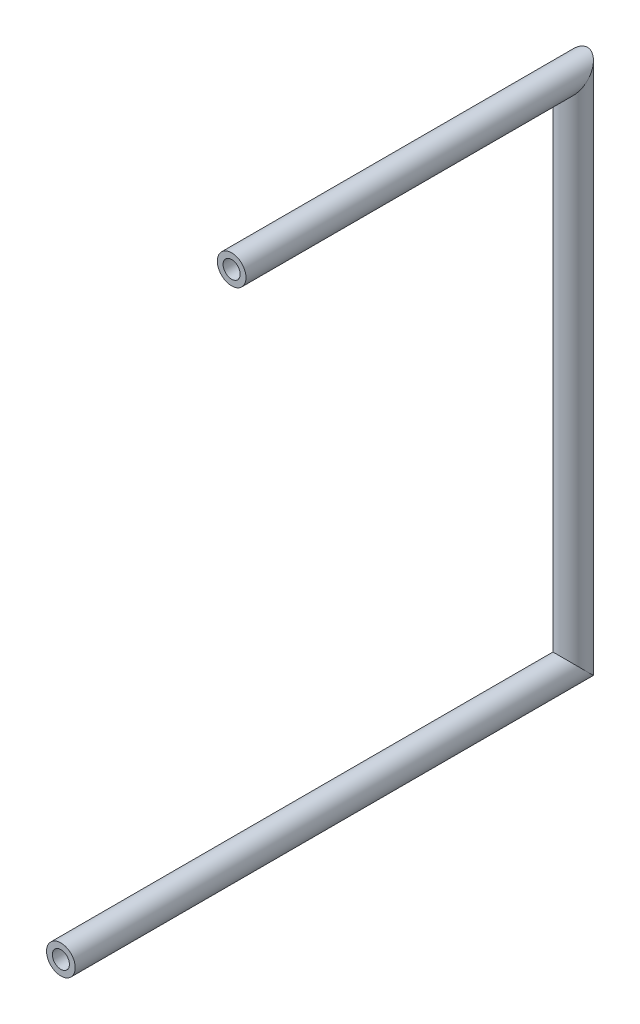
ISO-10303-21;
HEADER;
FILE_DESCRIPTION(('STEP AP214'),'2;1');
FILE_NAME('part.step','',(''),(''),'','','');
FILE_SCHEMA(('AUTOMOTIVE_DESIGN { 1 0 10303 214 1 1 1 1 }'));
ENDSEC;
DATA;
#1=APPLICATION_CONTEXT('core data for automotive mechanical design processes');
#2=APPLICATION_PROTOCOL_DEFINITION('international standard','automotive_design',2000,#1);
#3=PRODUCT_CONTEXT('',#1,'mechanical');
#4=PRODUCT('Part','Part','',(#3));
#5=PRODUCT_RELATED_PRODUCT_CATEGORY('part','',(#4));
#6=PRODUCT_DEFINITION_FORMATION('','',#4);
#7=PRODUCT_DEFINITION_CONTEXT('part definition',#1,'design');
#8=PRODUCT_DEFINITION('design','',#6,#7);
#9=PRODUCT_DEFINITION_SHAPE('','',#8);
#10=(LENGTH_UNIT() NAMED_UNIT(*) SI_UNIT(.MILLI.,.METRE.));
#11=(NAMED_UNIT(*) PLANE_ANGLE_UNIT() SI_UNIT($,.RADIAN.));
#12=(NAMED_UNIT(*) SI_UNIT($,.STERADIAN.) SOLID_ANGLE_UNIT());
#13=UNCERTAINTY_MEASURE_WITH_UNIT(LENGTH_MEASURE(1.E-05),#10,'distance_accuracy_value','');
#14=(GEOMETRIC_REPRESENTATION_CONTEXT(3) GLOBAL_UNCERTAINTY_ASSIGNED_CONTEXT((#13)) GLOBAL_UNIT_ASSIGNED_CONTEXT((#10,
#11,#12)) REPRESENTATION_CONTEXT('',''));
#15=CARTESIAN_POINT('',(0.,0.,0.));
#16=DIRECTION('',(0.,0.,1.));
#17=DIRECTION('',(1.,0.,0.));
#18=AXIS2_PLACEMENT_3D('',#15,#16,#17);
#19=CARTESIAN_POINT('',(0.,381.,-404.5696));
#20=DIRECTION('',(0.,0.,1.));
#21=DIRECTION('',(1.,0.,0.));
#22=AXIS2_PLACEMENT_3D('',#19,#20,#21);
#23=CYLINDRICAL_SURFACE('',#22,10.668);
#24=CARTESIAN_POINT('',(0.,381.,-381.));
#25=DIRECTION('',(0.,0.707106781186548,0.707106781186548));
#26=DIRECTION('',(0.,0.707106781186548,-0.707106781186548));
#27=AXIS2_PLACEMENT_3D('',#24,#25,#26);
#28=ELLIPSE('',#27,15.0868302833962,10.668);
#29=CARTESIAN_POINT('',(0.,391.668,-391.668));
#30=VERTEX_POINT('',#29);
#31=EDGE_CURVE('E34',#30,#30,#28,.T.);
#32=ORIENTED_EDGE('',*,*,#31,.T.);
#33=EDGE_LOOP('',(#32));
#34=FACE_BOUND('',#33,.T.);
#35=CARTESIAN_POINT('',(0.,381.,-127.));
#36=DIRECTION('',(0.,0.,-1.));
#37=DIRECTION('',(1.,0.,0.));
#38=AXIS2_PLACEMENT_3D('',#35,#36,#37);
#39=CIRCLE('',#38,10.668);
#40=CARTESIAN_POINT('',(10.668,381.,-127.));
#41=VERTEX_POINT('',#40);
#42=EDGE_CURVE('E54',#41,#41,#39,.T.);
#43=ORIENTED_EDGE('',*,*,#42,.T.);
#44=EDGE_LOOP('',(#43));
#45=FACE_BOUND('',#44,.T.);
#46=ADVANCED_FACE('F31',(#34,#45),#23,.T.);
#47=CARTESIAN_POINT('',(0.,-23.5695999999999,-381.));
#48=DIRECTION('',(0.,1.,0.));
#49=DIRECTION('',(0.,0.,1.));
#50=AXIS2_PLACEMENT_3D('',#47,#48,#49);
#51=CYLINDRICAL_SURFACE('',#50,10.668);
#52=CARTESIAN_POINT('',(0.,0.,-381.));
#53=DIRECTION('',(0.,0.707106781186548,-0.707106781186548));
#54=DIRECTION('',(0.,-0.707106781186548,-0.707106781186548));
#55=AXIS2_PLACEMENT_3D('',#52,#53,#54);
#56=ELLIPSE('',#55,15.0868302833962,10.668);
#57=CARTESIAN_POINT('',(0.,-10.668,-391.668));
#58=VERTEX_POINT('',#57);
#59=EDGE_CURVE('E56',#58,#58,#56,.T.);
#60=ORIENTED_EDGE('',*,*,#59,.T.);
#61=EDGE_LOOP('',(#60));
#62=FACE_BOUND('',#61,.T.);
#63=ORIENTED_EDGE('',*,*,#31,.F.);
#64=EDGE_LOOP('',(#63));
#65=FACE_BOUND('',#64,.T.);
#66=ADVANCED_FACE('F65',(#62,#65),#51,.T.);
#67=CARTESIAN_POINT('',(0.,0.,0.));
#68=DIRECTION('',(0.,0.,-1.));
#69=DIRECTION('',(-1.,0.,0.));
#70=AXIS2_PLACEMENT_3D('',#67,#68,#69);
#71=CYLINDRICAL_SURFACE('',#70,10.668);
#72=CARTESIAN_POINT('',(0.,0.,0.));
#73=DIRECTION('',(0.,0.,1.));
#74=DIRECTION('',(1.,0.,0.));
#75=AXIS2_PLACEMENT_3D('',#72,#73,#74);
#76=CIRCLE('',#75,10.668);
#77=CARTESIAN_POINT('',(10.668,0.,0.));
#78=VERTEX_POINT('',#77);
#79=EDGE_CURVE('E51',#78,#78,#76,.T.);
#80=ORIENTED_EDGE('',*,*,#79,.F.);
#81=EDGE_LOOP('',(#80));
#82=FACE_BOUND('',#81,.T.);
#83=ORIENTED_EDGE('',*,*,#59,.F.);
#84=EDGE_LOOP('',(#83));
#85=FACE_BOUND('',#84,.T.);
#86=ADVANCED_FACE('F67',(#82,#85),#71,.T.);
#87=CARTESIAN_POINT('',(0.,381.,-127.));
#88=DIRECTION('',(0.,0.,-1.));
#89=DIRECTION('',(1.,0.,0.));
#90=AXIS2_PLACEMENT_3D('',#87,#88,#89);
#91=PLANE('',#90);
#92=CARTESIAN_POINT('',(0.,381.,-127.));
#93=DIRECTION('',(0.,0.,-1.));
#94=DIRECTION('',(1.,0.,0.));
#95=AXIS2_PLACEMENT_3D('',#92,#93,#94);
#96=CIRCLE('',#95,6.35);
#97=CARTESIAN_POINT('',(6.35,381.,-127.));
#98=VERTEX_POINT('',#97);
#99=EDGE_CURVE('E48',#98,#98,#96,.F.);
#100=ORIENTED_EDGE('',*,*,#99,.F.);
#101=EDGE_LOOP('',(#100));
#102=FACE_BOUND('',#101,.T.);
#103=ORIENTED_EDGE('',*,*,#42,.F.);
#104=EDGE_LOOP('',(#103));
#105=FACE_BOUND('',#104,.T.);
#106=ADVANCED_FACE('F72',(#102,#105),#91,.F.);
#107=CARTESIAN_POINT('',(0.,0.,0.));
#108=DIRECTION('',(0.,0.,1.));
#109=DIRECTION('',(1.,0.,0.));
#110=AXIS2_PLACEMENT_3D('',#107,#108,#109);
#111=PLANE('',#110);
#112=CARTESIAN_POINT('',(0.,0.,0.));
#113=DIRECTION('',(0.,0.,1.));
#114=DIRECTION('',(1.,0.,0.));
#115=AXIS2_PLACEMENT_3D('',#112,#113,#114);
#116=CIRCLE('',#115,6.35);
#117=CARTESIAN_POINT('',(6.35,0.,0.));
#118=VERTEX_POINT('',#117);
#119=EDGE_CURVE('E38',#118,#118,#116,.F.);
#120=ORIENTED_EDGE('',*,*,#119,.T.);
#121=EDGE_LOOP('',(#120));
#122=FACE_BOUND('',#121,.T.);
#123=ORIENTED_EDGE('',*,*,#79,.T.);
#124=EDGE_LOOP('',(#123));
#125=FACE_BOUND('',#124,.T.);
#126=ADVANCED_FACE('F90',(#122,#125),#111,.T.);
#127=CARTESIAN_POINT('',(0.,381.,-395.07));
#128=DIRECTION('',(0.,0.,1.));
#129=DIRECTION('',(1.,0.,0.));
#130=AXIS2_PLACEMENT_3D('',#127,#128,#129);
#131=CYLINDRICAL_SURFACE('',#130,6.35);
#132=CARTESIAN_POINT('',(0.,381.,-381.));
#133=DIRECTION('',(0.,0.707106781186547,0.707106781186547));
#134=DIRECTION('',(0.,0.707106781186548,-0.707106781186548));
#135=AXIS2_PLACEMENT_3D('',#132,#133,#134);
#136=ELLIPSE('',#135,8.98025612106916,6.35);
#137=CARTESIAN_POINT('',(0.,387.35,-387.35));
#138=VERTEX_POINT('',#137);
#139=EDGE_CURVE('E43',#138,#138,#136,.F.);
#140=ORIENTED_EDGE('',*,*,#139,.T.);
#141=EDGE_LOOP('',(#140));
#142=FACE_BOUND('',#141,.T.);
#143=ORIENTED_EDGE('',*,*,#99,.T.);
#144=EDGE_LOOP('',(#143));
#145=FACE_BOUND('',#144,.T.);
#146=ADVANCED_FACE('F83',(#142,#145),#131,.F.);
#147=CARTESIAN_POINT('',(0.,-14.0699999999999,-381.));
#148=DIRECTION('',(0.,1.,0.));
#149=DIRECTION('',(0.,0.,1.));
#150=AXIS2_PLACEMENT_3D('',#147,#148,#149);
#151=CYLINDRICAL_SURFACE('',#150,6.35);
#152=CARTESIAN_POINT('',(0.,0.,-381.));
#153=DIRECTION('',(0.,0.707106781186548,-0.707106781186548));
#154=DIRECTION('',(0.,-0.707106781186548,-0.707106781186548));
#155=AXIS2_PLACEMENT_3D('',#152,#153,#154);
#156=ELLIPSE('',#155,8.98025612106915,6.35);
#157=CARTESIAN_POINT('',(0.,-6.35,-387.35));
#158=VERTEX_POINT('',#157);
#159=EDGE_CURVE('E10',#158,#158,#156,.F.);
#160=ORIENTED_EDGE('',*,*,#159,.T.);
#161=EDGE_LOOP('',(#160));
#162=FACE_BOUND('',#161,.T.);
#163=ORIENTED_EDGE('',*,*,#139,.F.);
#164=EDGE_LOOP('',(#163));
#165=FACE_BOUND('',#164,.T.);
#166=ADVANCED_FACE('F77',(#162,#165),#151,.F.);
#167=CARTESIAN_POINT('',(0.,0.,0.));
#168=DIRECTION('',(0.,0.,-1.));
#169=DIRECTION('',(-1.,0.,0.));
#170=AXIS2_PLACEMENT_3D('',#167,#168,#169);
#171=CYLINDRICAL_SURFACE('',#170,6.35);
#172=ORIENTED_EDGE('',*,*,#119,.F.);
#173=EDGE_LOOP('',(#172));
#174=FACE_BOUND('',#173,.T.);
#175=ORIENTED_EDGE('',*,*,#159,.F.);
#176=EDGE_LOOP('',(#175));
#177=FACE_BOUND('',#176,.T.);
#178=ADVANCED_FACE('F75',(#174,#177),#171,.F.);
#179=CLOSED_SHELL('',(#46,#66,#86,#106,#126,#146,#166,#178));
#180=MANIFOLD_SOLID_BREP('B2',#179);
#181=ADVANCED_BREP_SHAPE_REPRESENTATION('',(#18,#180),#14);
#182=SHAPE_DEFINITION_REPRESENTATION(#9,#181);
ENDSEC;
END-ISO-10303-21;
